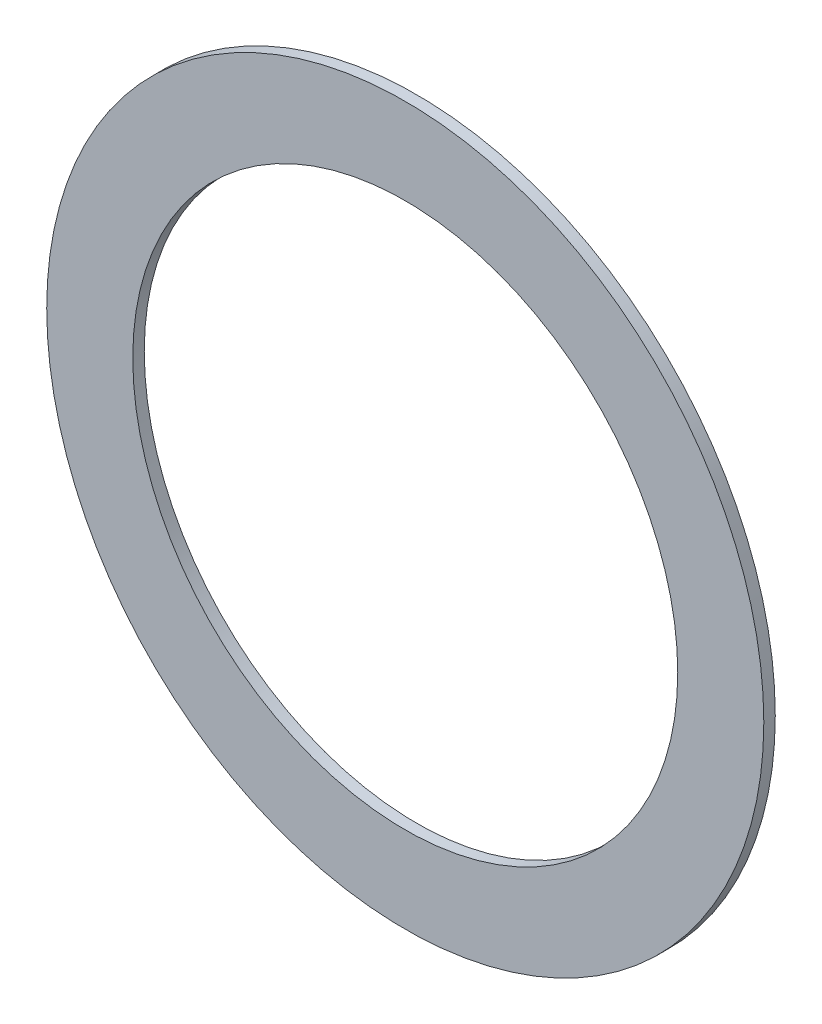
ISO-10303-21;
HEADER;
FILE_DESCRIPTION(('STEP AP214'),'2;1');
FILE_NAME('part.step','',(''),(''),'','','');
FILE_SCHEMA(('AUTOMOTIVE_DESIGN { 1 0 10303 214 1 1 1 1 }'));
ENDSEC;
DATA;
#1=APPLICATION_CONTEXT('core data for automotive mechanical design processes');
#2=APPLICATION_PROTOCOL_DEFINITION('international standard','automotive_design',2000,#1);
#3=PRODUCT_CONTEXT('',#1,'mechanical');
#4=PRODUCT('Part','Part','',(#3));
#5=PRODUCT_RELATED_PRODUCT_CATEGORY('part','',(#4));
#6=PRODUCT_DEFINITION_FORMATION('','',#4);
#7=PRODUCT_DEFINITION_CONTEXT('part definition',#1,'design');
#8=PRODUCT_DEFINITION('design','',#6,#7);
#9=PRODUCT_DEFINITION_SHAPE('','',#8);
#10=(LENGTH_UNIT() NAMED_UNIT(*) SI_UNIT(.MILLI.,.METRE.));
#11=(NAMED_UNIT(*) PLANE_ANGLE_UNIT() SI_UNIT($,.RADIAN.));
#12=(NAMED_UNIT(*) SI_UNIT($,.STERADIAN.) SOLID_ANGLE_UNIT());
#13=UNCERTAINTY_MEASURE_WITH_UNIT(LENGTH_MEASURE(1.E-05),#10,'distance_accuracy_value','');
#14=(GEOMETRIC_REPRESENTATION_CONTEXT(3) GLOBAL_UNCERTAINTY_ASSIGNED_CONTEXT((#13)) GLOBAL_UNIT_ASSIGNED_CONTEXT((#10,
#11,#12)) REPRESENTATION_CONTEXT('',''));
#15=CARTESIAN_POINT('',(0.,0.,0.));
#16=DIRECTION('',(0.,0.,1.));
#17=DIRECTION('',(1.,0.,0.));
#18=AXIS2_PLACEMENT_3D('',#15,#16,#17);
#19=CARTESIAN_POINT('',(0.,0.,20.7264));
#20=DIRECTION('',(0.,0.,-1.));
#21=DIRECTION('',(-1.,0.,0.));
#22=AXIS2_PLACEMENT_3D('',#19,#20,#21);
#23=CYLINDRICAL_SURFACE('',#22,12.7);
#24=CARTESIAN_POINT('',(0.,0.,20.7264));
#25=DIRECTION('',(0.,0.,1.));
#26=DIRECTION('',(1.,0.,0.));
#27=AXIS2_PLACEMENT_3D('',#24,#25,#26);
#28=CIRCLE('',#27,12.7);
#29=CARTESIAN_POINT('',(12.7,0.,20.7264));
#30=VERTEX_POINT('',#29);
#31=EDGE_CURVE('E30',#30,#30,#28,.T.);
#32=ORIENTED_EDGE('',*,*,#31,.F.);
#33=EDGE_LOOP('',(#32));
#34=FACE_BOUND('',#33,.T.);
#35=CARTESIAN_POINT('',(0.,0.,20.32));
#36=DIRECTION('',(0.,0.,-1.));
#37=DIRECTION('',(-1.,0.,0.));
#38=AXIS2_PLACEMENT_3D('',#35,#36,#37);
#39=CIRCLE('',#38,12.7);
#40=CARTESIAN_POINT('',(-12.7,0.,20.32));
#41=VERTEX_POINT('',#40);
#42=EDGE_CURVE('E26',#41,#41,#39,.T.);
#43=ORIENTED_EDGE('',*,*,#42,.F.);
#44=EDGE_LOOP('',(#43));
#45=FACE_BOUND('',#44,.T.);
#46=ADVANCED_FACE('F15',(#34,#45),#23,.T.);
#47=CARTESIAN_POINT('',(-12.7,-12.7,20.7264));
#48=DIRECTION('',(0.,0.,1.));
#49=DIRECTION('',(1.,0.,0.));
#50=AXIS2_PLACEMENT_3D('',#47,#48,#49);
#51=PLANE('',#50);
#52=CARTESIAN_POINT('',(0.,0.,20.7264));
#53=DIRECTION('',(0.,0.,1.));
#54=DIRECTION('',(1.,0.,0.));
#55=AXIS2_PLACEMENT_3D('',#52,#53,#54);
#56=CIRCLE('',#55,9.652);
#57=CARTESIAN_POINT('',(9.65200000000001,0.,20.7264));
#58=VERTEX_POINT('',#57);
#59=EDGE_CURVE('E19',#58,#58,#56,.T.);
#60=ORIENTED_EDGE('',*,*,#59,.F.);
#61=EDGE_LOOP('',(#60));
#62=FACE_BOUND('',#61,.T.);
#63=ORIENTED_EDGE('',*,*,#31,.T.);
#64=EDGE_LOOP('',(#63));
#65=FACE_BOUND('',#64,.T.);
#66=ADVANCED_FACE('F34',(#62,#65),#51,.T.);
#67=CARTESIAN_POINT('',(12.7,-14.0711561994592,20.32));
#68=DIRECTION('',(0.,0.,-1.));
#69=DIRECTION('',(-1.,0.,0.));
#70=AXIS2_PLACEMENT_3D('',#67,#68,#69);
#71=PLANE('',#70);
#72=CARTESIAN_POINT('',(0.,0.,20.32));
#73=DIRECTION('',(0.,0.,-1.));
#74=DIRECTION('',(-1.,0.,0.));
#75=AXIS2_PLACEMENT_3D('',#72,#73,#74);
#76=CIRCLE('',#75,9.652);
#77=CARTESIAN_POINT('',(-9.652,0.,20.32));
#78=VERTEX_POINT('',#77);
#79=EDGE_CURVE('E10',#78,#78,#76,.T.);
#80=ORIENTED_EDGE('',*,*,#79,.F.);
#81=EDGE_LOOP('',(#80));
#82=FACE_BOUND('',#81,.T.);
#83=ORIENTED_EDGE('',*,*,#42,.T.);
#84=EDGE_LOOP('',(#83));
#85=FACE_BOUND('',#84,.T.);
#86=ADVANCED_FACE('F41',(#82,#85),#71,.T.);
#87=CARTESIAN_POINT('',(0.,0.,20.7264));
#88=DIRECTION('',(0.,0.,-1.));
#89=DIRECTION('',(-1.,0.,0.));
#90=AXIS2_PLACEMENT_3D('',#87,#88,#89);
#91=CYLINDRICAL_SURFACE('',#90,9.652);
#92=ORIENTED_EDGE('',*,*,#59,.T.);
#93=EDGE_LOOP('',(#92));
#94=FACE_BOUND('',#93,.T.);
#95=ORIENTED_EDGE('',*,*,#79,.T.);
#96=EDGE_LOOP('',(#95));
#97=FACE_BOUND('',#96,.T.);
#98=ADVANCED_FACE('F17',(#94,#97),#91,.F.);
#99=CLOSED_SHELL('',(#46,#66,#86,#98));
#100=MANIFOLD_SOLID_BREP('B1',#99);
#101=ADVANCED_BREP_SHAPE_REPRESENTATION('',(#18,#100),#14);
#102=SHAPE_DEFINITION_REPRESENTATION(#9,#101);
ENDSEC;
END-ISO-10303-21;
